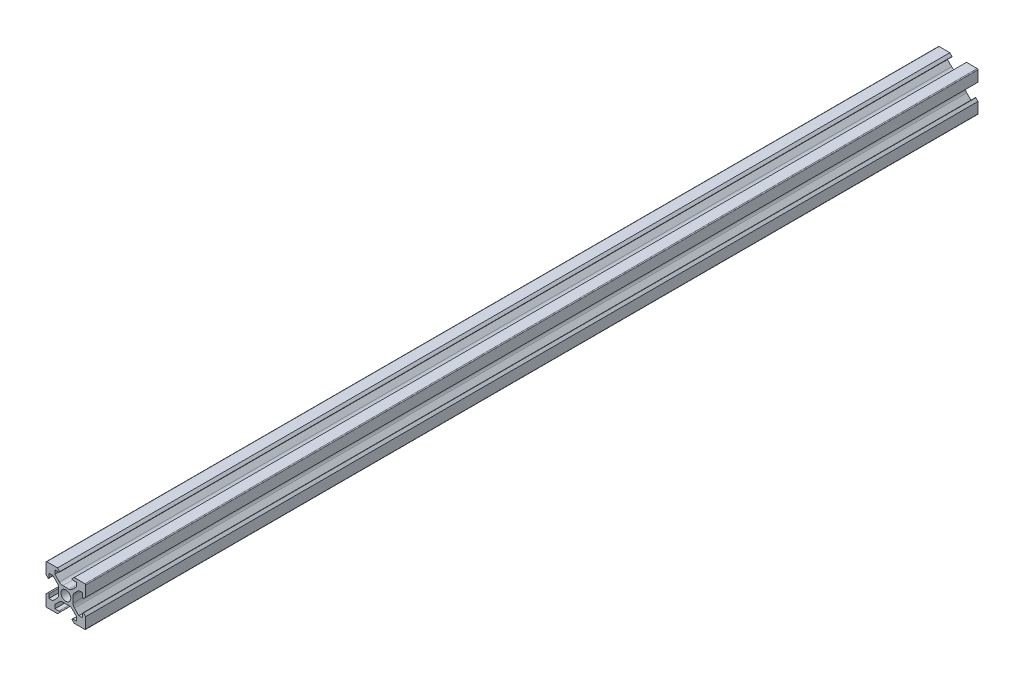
from build123d import *

# Parameters (mm, degrees)
RESSALTO_EXTRUS_O1_DEPTH = 225


with BuildPart() as part:
    # Esbo_o1 → Ressalto-extrus_o1 (new, symmetric)
    with BuildSketch(Plane.XY):
        with BuildLine():
            Line((-3.1, 8.9), (-4.2, 10))
            Line((-4.2, 10), (-9.6, 10))
            ThreePointArc((-9.6, 10), (-9.882842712, 9.882842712), (-10, 9.6))
            Line((-10, 9.6), (-10, 4.2))
            Line((-10, 4.2), (-8.9, 3.1))
            ThreePointArc((-8.9, 3.1), (-8.617157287, 3.217157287), (-8.5, 3.5))
            Line((-8.5, 3.5), (-8.5, 5.5))
            Line((-8.5, 5.5), (-6.560660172, 5.5))
            Line((-6.560660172, 5.5), (-4.332233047, 3.271572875))
            ThreePointArc((-4.332233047, 3.271572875), (-3.790301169, 2.460514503), (-3.6, 1.503805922))
            Line((-3.6, 1.503805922), (-3.6, 0))
            Line((-3.6, 0), (-3.6, -1.503805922))
            ThreePointArc((-3.6, -1.503805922), (-3.790301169, -2.460514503), (-4.332233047, -3.271572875))
            Line((-4.332233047, -3.271572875), (-6.560660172, -5.5))
            Line((-6.560660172, -5.5), (-8.5, -5.5))
            Line((-8.5, -5.5), (-8.5, -3.5))
            ThreePointArc((-8.5, -3.5), (-8.617157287, -3.217157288), (-8.9, -3.1))
            Line((-8.9, -3.1), (-10, -4.2))
            Line((-10, -4.2), (-10, -9.6))
            ThreePointArc((-10, -9.6), (-9.882842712, -9.882842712), (-9.6, -10))
            Line((-9.6, -10), (-4.2, -10))
            Line((-4.2, -10), (-3.1, -8.9))
            ThreePointArc((-3.1, -8.9), (-3.217157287, -8.617157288), (-3.5, -8.5))
            Line((-3.5, -8.5), (-5.5, -8.5))
            Line((-5.5, -8.5), (-5.5, -6.560660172))
            Line((-5.5, -6.560660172), (-3.271572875, -4.332233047))
            ThreePointArc((-3.271572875, -4.332233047), (-2.460514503, -3.790301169), (-1.503805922, -3.6))
            Line((-1.503805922, -3.6), (1.503805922, -3.6))
            ThreePointArc((1.503805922, -3.6), (2.460514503, -3.790301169), (3.271572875, -4.332233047))
            Line((3.271572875, -4.332233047), (5.5, -6.560660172))
            Line((5.5, -6.560660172), (5.5, -8.5))
            Line((5.5, -8.5), (3.5, -8.5))
            ThreePointArc((3.5, -8.5), (3.217157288, -8.617157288), (3.1, -8.9))
            Line((3.1, -8.9), (4.2, -10))
            Line((4.2, -10), (9.6, -10))
            ThreePointArc((9.6, -10), (9.882842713, -9.882842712), (10, -9.6))
            Line((10, -9.6), (10, -4.2))
            Line((10, -4.2), (8.9, -3.1))
            ThreePointArc((8.9, -3.1), (8.617157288, -3.217157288), (8.5, -3.5))
            Line((8.5, -3.5), (8.5, -5.5))
            Line((8.5, -5.5), (6.560660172, -5.5))
            Line((6.560660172, -5.5), (4.332233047, -3.271572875))
            ThreePointArc((4.332233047, -3.271572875), (3.790301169, -2.460514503), (3.6, -1.503805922))
            Line((3.6, -1.503805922), (3.6, 0))
            Line((3.6, 0), (3.6, 1.503805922))
            ThreePointArc((3.6, 1.503805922), (3.790301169, 2.460514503), (4.332233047, 3.271572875))
            Line((4.332233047, 3.271572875), (6.560660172, 5.5))
            Line((6.560660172, 5.5), (8.5, 5.5))
            Line((8.5, 5.5), (8.5, 3.5))
            ThreePointArc((8.5, 3.5), (8.617157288, 3.217157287), (8.9, 3.1))
            Line((8.9, 3.1), (10, 4.2))
            Line((10, 4.2), (10, 9.6))
            ThreePointArc((10, 9.6), (9.882842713, 9.882842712), (9.6, 10))
            Line((9.6, 10), (4.2, 10))
            Line((4.2, 10), (3.1, 8.9))
            ThreePointArc((3.1, 8.9), (3.217157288, 8.617157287), (3.5, 8.5))
            Line((3.5, 8.5), (5.5, 8.5))
            Line((5.5, 8.5), (5.5, 6.560660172))
            Line((5.5, 6.560660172), (3.271572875, 4.332233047))
            ThreePointArc((3.271572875, 4.332233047), (2.460514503, 3.790301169), (1.503805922, 3.6))
            Line((1.503805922, 3.6), (-1.503805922, 3.6))
            ThreePointArc((-1.503805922, 3.6), (-2.460514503, 3.790301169), (-3.271572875, 4.332233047))
            Line((-3.271572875, 4.332233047), (-5.5, 6.560660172))
            Line((-5.5, 6.560660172), (-5.5, 8.5))
            Line((-5.5, 8.5), (-3.5, 8.5))
            ThreePointArc((-3.5, 8.5), (-3.217157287, 8.617157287), (-3.1, 8.9))
        make_face()
        with BuildLine():
            ThreePointArc((2.5, 0), (0, 2.5), (-2.5, 0))
            ThreePointArc((-2.5, 0), (0, -2.5), (2.5, 0))
        make_face(mode=Mode.SUBTRACT)
    extrude(amount=RESSALTO_EXTRUS_O1_DEPTH, both=True)


solid = part.part
